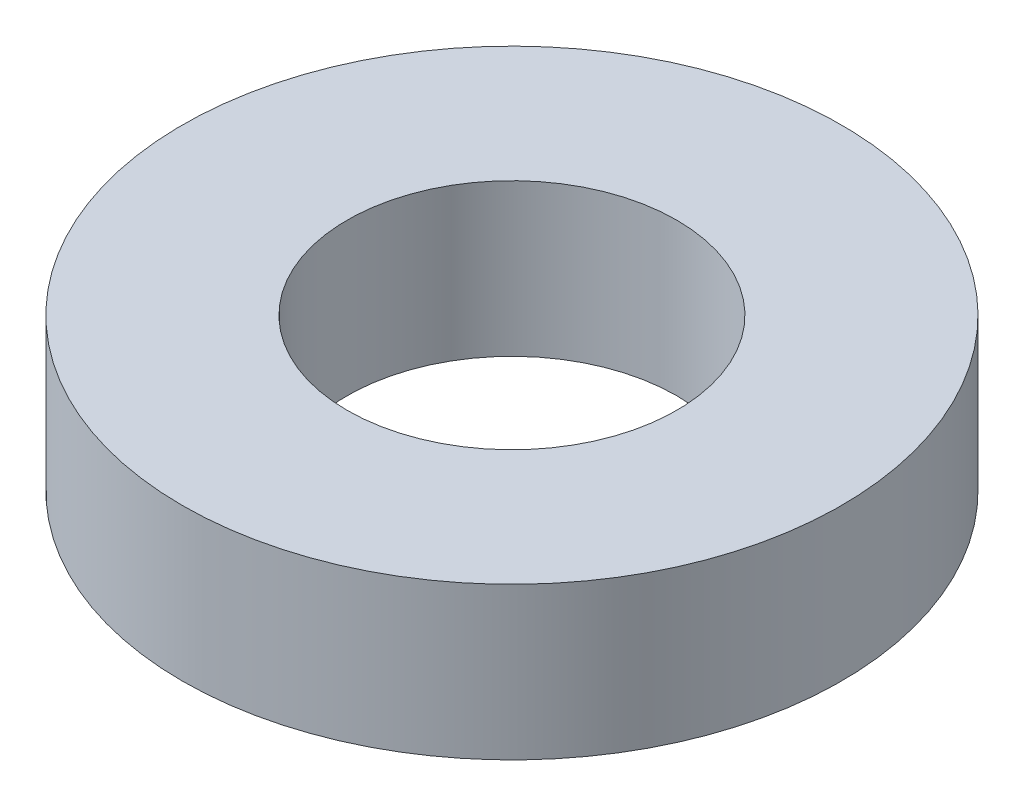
ISO-10303-21;
HEADER;
FILE_DESCRIPTION(('STEP AP214'),'2;1');
FILE_NAME('part.step','',(''),(''),'','','');
FILE_SCHEMA(('AUTOMOTIVE_DESIGN { 1 0 10303 214 1 1 1 1 }'));
ENDSEC;
DATA;
#1=APPLICATION_CONTEXT('core data for automotive mechanical design processes');
#2=APPLICATION_PROTOCOL_DEFINITION('international standard','automotive_design',2000,#1);
#3=PRODUCT_CONTEXT('',#1,'mechanical');
#4=PRODUCT('Part','Part','',(#3));
#5=PRODUCT_RELATED_PRODUCT_CATEGORY('part','',(#4));
#6=PRODUCT_DEFINITION_FORMATION('','',#4);
#7=PRODUCT_DEFINITION_CONTEXT('part definition',#1,'design');
#8=PRODUCT_DEFINITION('design','',#6,#7);
#9=PRODUCT_DEFINITION_SHAPE('','',#8);
#10=(LENGTH_UNIT() NAMED_UNIT(*) SI_UNIT(.MILLI.,.METRE.));
#11=(NAMED_UNIT(*) PLANE_ANGLE_UNIT() SI_UNIT($,.RADIAN.));
#12=(NAMED_UNIT(*) SI_UNIT($,.STERADIAN.) SOLID_ANGLE_UNIT());
#13=UNCERTAINTY_MEASURE_WITH_UNIT(LENGTH_MEASURE(1.E-05),#10,'distance_accuracy_value','');
#14=(GEOMETRIC_REPRESENTATION_CONTEXT(3) GLOBAL_UNCERTAINTY_ASSIGNED_CONTEXT((#13)) GLOBAL_UNIT_ASSIGNED_CONTEXT((#10,
#11,#12)) REPRESENTATION_CONTEXT('',''));
#15=CARTESIAN_POINT('',(0.,0.,0.));
#16=DIRECTION('',(0.,0.,1.));
#17=DIRECTION('',(1.,0.,0.));
#18=AXIS2_PLACEMENT_3D('',#15,#16,#17);
#19=CARTESIAN_POINT('',(0.,3.,0.));
#20=DIRECTION('',(0.,1.,0.));
#21=DIRECTION('',(0.,0.,1.));
#22=AXIS2_PLACEMENT_3D('',#19,#20,#21);
#23=PLANE('',#22);
#24=CARTESIAN_POINT('',(0.,3.,0.));
#25=DIRECTION('',(0.,1.,0.));
#26=DIRECTION('',(0.,0.,1.));
#27=AXIS2_PLACEMENT_3D('',#24,#25,#26);
#28=CIRCLE('',#27,6.5);
#29=CARTESIAN_POINT('',(0.,3.,6.5));
#30=VERTEX_POINT('',#29);
#31=EDGE_CURVE('E10',#30,#30,#28,.T.);
#32=ORIENTED_EDGE('',*,*,#31,.T.);
#33=EDGE_LOOP('',(#32));
#34=FACE_BOUND('',#33,.T.);
#35=CARTESIAN_POINT('',(0.,3.,0.));
#36=DIRECTION('',(0.,1.,0.));
#37=DIRECTION('',(0.,0.,1.));
#38=AXIS2_PLACEMENT_3D('',#35,#36,#37);
#39=CIRCLE('',#38,3.25);
#40=CARTESIAN_POINT('',(0.,3.,3.25));
#41=VERTEX_POINT('',#40);
#42=EDGE_CURVE('E57',#41,#41,#39,.T.);
#43=ORIENTED_EDGE('',*,*,#42,.F.);
#44=EDGE_LOOP('',(#43));
#45=FACE_BOUND('',#44,.T.);
#46=ADVANCED_FACE('F43',(#34,#45),#23,.T.);
#47=CARTESIAN_POINT('',(0.,0.,0.));
#48=DIRECTION('',(0.,1.,0.));
#49=DIRECTION('',(0.,0.,1.));
#50=AXIS2_PLACEMENT_3D('',#47,#48,#49);
#51=PLANE('',#50);
#52=CARTESIAN_POINT('',(0.,0.,0.));
#53=DIRECTION('',(0.,1.,0.));
#54=DIRECTION('',(0.,0.,1.));
#55=AXIS2_PLACEMENT_3D('',#52,#53,#54);
#56=CIRCLE('',#55,6.5);
#57=CARTESIAN_POINT('',(0.,0.,6.5));
#58=VERTEX_POINT('',#57);
#59=EDGE_CURVE('E50',#58,#58,#56,.T.);
#60=ORIENTED_EDGE('',*,*,#59,.F.);
#61=EDGE_LOOP('',(#60));
#62=FACE_BOUND('',#61,.T.);
#63=CARTESIAN_POINT('',(0.,0.,0.));
#64=DIRECTION('',(0.,1.,0.));
#65=DIRECTION('',(0.,0.,1.));
#66=AXIS2_PLACEMENT_3D('',#63,#64,#65);
#67=CIRCLE('',#66,3.25);
#68=CARTESIAN_POINT('',(0.,0.,3.25));
#69=VERTEX_POINT('',#68);
#70=EDGE_CURVE('E59',#69,#69,#67,.T.);
#71=ORIENTED_EDGE('',*,*,#70,.T.);
#72=EDGE_LOOP('',(#71));
#73=FACE_BOUND('',#72,.T.);
#74=ADVANCED_FACE('F68',(#62,#73),#51,.F.);
#75=CARTESIAN_POINT('',(0.,3.,0.));
#76=DIRECTION('',(0.,-1.,0.));
#77=DIRECTION('',(0.,0.,-1.));
#78=AXIS2_PLACEMENT_3D('',#75,#76,#77);
#79=CYLINDRICAL_SURFACE('',#78,6.5);
#80=ORIENTED_EDGE('',*,*,#31,.F.);
#81=EDGE_LOOP('',(#80));
#82=FACE_BOUND('',#81,.T.);
#83=ORIENTED_EDGE('',*,*,#59,.T.);
#84=EDGE_LOOP('',(#83));
#85=FACE_BOUND('',#84,.T.);
#86=ADVANCED_FACE('F44',(#82,#85),#79,.T.);
#87=CARTESIAN_POINT('',(0.,3.,0.));
#88=DIRECTION('',(0.,-1.,0.));
#89=DIRECTION('',(0.,0.,-1.));
#90=AXIS2_PLACEMENT_3D('',#87,#88,#89);
#91=CYLINDRICAL_SURFACE('',#90,3.25);
#92=ORIENTED_EDGE('',*,*,#42,.T.);
#93=EDGE_LOOP('',(#92));
#94=FACE_BOUND('',#93,.T.);
#95=ORIENTED_EDGE('',*,*,#70,.F.);
#96=EDGE_LOOP('',(#95));
#97=FACE_BOUND('',#96,.T.);
#98=ADVANCED_FACE('F67',(#94,#97),#91,.F.);
#99=CLOSED_SHELL('',(#46,#74,#86,#98));
#100=MANIFOLD_SOLID_BREP('B2',#99);
#101=ADVANCED_BREP_SHAPE_REPRESENTATION('',(#18,#100),#14);
#102=SHAPE_DEFINITION_REPRESENTATION(#9,#101);
ENDSEC;
END-ISO-10303-21;
